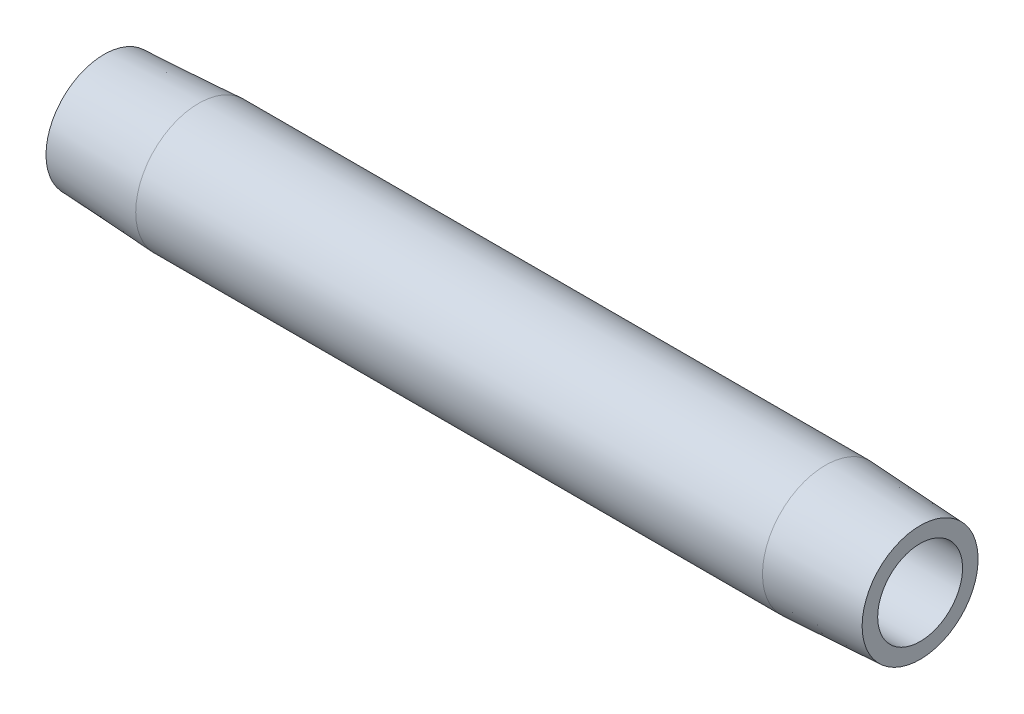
from build123d import *


with BuildPart() as part:
    # Sketch1 → Revolve1 (revolve)
    with BuildSketch(Plane(origin=(0, 0, 0), x_dir=(1, 0, 0), z_dir=(0, 1, 0)), mode=Mode.PRIVATE) as revolve1_sk:
        Polygon((88.9, 4.622776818), (0, 4.622776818), (0, 6.317526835), (10.3124, 6.857976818), (78.5876, 6.857976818), (88.9, 6.317526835), align=None)
    revolve(revolve1_sk.sketch.rotate(Axis((-6.375994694, 0, 0), (1, 0, 0)), 180), axis=Axis((-6.375994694, 0, 0), (1, 0, 0)))


solid = part.part
